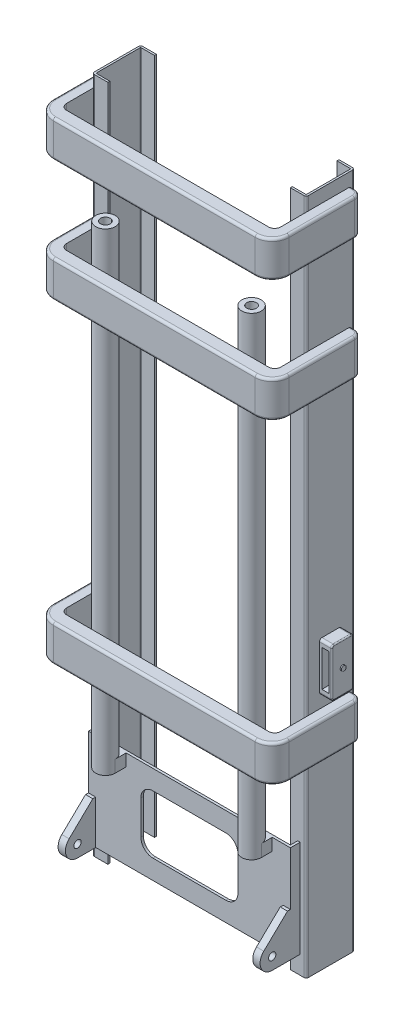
from build123d import *

# Parameters (mm, degrees)
BOSS_EXTRUDE1_DEPTH     = 2790
BOSS_EXTRUDE1_2_DEPTH   = 2790
BOSS_EXTRUDE2_START     = 75
BOSS_EXTRUDE2_DEPTH     = 400
BOSS_EXTRUDE3_START     = 25
SKETCH6_R               = 15
BOSS_EXTRUDE3_DEPTH     = 30
BOSS_EXTRUDE4_START     = 785
BOSS_EXTRUDE4_DEPTH     = 150
FILLET1_R               = 10
LPATTERN2_COUNT         = 2
LPATTERN2_PITCH         = 1800
FILLET1_OF_LPATTERN2_R  = 10
LPATTERN20_COUNT        = 2
LPATTERN20_PITCH        = 1300
FILLET1_OF_LPATTERN20_R = 10
CUT_EXTRUDE1_REACH      = 2951.751
BOSS_EXTRUDE5_DEPTH     = 50
BOSS_EXTRUDE6_START     = 1900
SKETCH10_R              = 40
SKETCH10_R_2            = 20
BOSS_EXTRUDE6_DEPTH     = 1900
BOSS_EXTRUDE7_DEPTH     = 50
SKETCH12_W              = 30
SKETCH12_H              = 150
CUT_EXTRUDE2_DEPTH      = 70
BOSS_EXTRUDE8_START     = -50
SKETCH13_R              = 10
BOSS_EXTRUDE8_DEPTH     = 55
FILLET2_R               = 5
FILLET2_OF_MIRROR2_R    = 5


with BuildPart() as part:
    # Sketch2 → Boss-Extrude1 (new body)
    with BuildSketch(Plane(origin=(0, 0, 0), x_dir=(1, 0, 0), z_dir=(0, 1, 0))):
        with BuildLine():
            Line((0, 10), (0, 190))
            ThreePointArc((0, 190), (2.928932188, 197.071067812), (10, 200))
            Line((10, 200), (65, 200))
            Line((65, 200), (65, 192))
            Line((65, 192), (10, 192))
            ThreePointArc((10, 192), (8.585786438, 191.414213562), (8, 190))
            Line((8, 190), (8, 10))
            ThreePointArc((8, 10), (8.585786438, 8.585786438), (10, 8))
            Line((10, 8), (65, 8))
            Line((65, 8), (65, 0))
            Line((65, 0), (10, 0))
            ThreePointArc((10, 0), (2.928932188, 2.928932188), (0, 10))
        make_face()
    extrude(amount=BOSS_EXTRUDE1_DEPTH)



with BuildPart() as body_2:
    # Sketch2 → Boss-Extrude1 2 (new body)
    with BuildSketch(Plane(origin=(0, 0, 0), x_dir=(1, 0, 0), z_dir=(0, 1, 0))):
        with BuildLine():
            Line((817, 8), (817, 0))
            Line((817, 0), (872, 0))
            ThreePointArc((872, 0), (879.071067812, 2.928932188), (882, 10))
            Line((882, 10), (882, 190))
            ThreePointArc((882, 190), (879.071067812, 197.071067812), (872, 200))
            Line((872, 200), (817, 200))
            Line((817, 200), (817, 192))
            Line((817, 192), (872, 192))
            ThreePointArc((872, 192), (873.414213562, 191.414213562), (874, 190))
            Line((874, 190), (874, 10))
            ThreePointArc((874, 10), (873.414213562, 8.585786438), (872, 8))
            Line((872, 8), (817, 8))
        make_face()
    extrude(amount=BOSS_EXTRUDE1_2_DEPTH)


with BuildPart() as part_1:
    add(part.part)

    add(body_2.part)  # Boss-Extrude2 merges body 2
    # Sketch4 → Boss-Extrude2 (add)
    with BuildSketch(Plane(origin=(0, 0, 0), x_dir=(1, 0, 0), z_dir=(0, 1, 0)).offset(BOSS_EXTRUDE2_START)):
        Polygon((25, 0), (25, -40), (857, -40), (857, 0), (847, 0), (847, -30), (35, -30), (35, 0), align=None)
    extrude(amount=BOSS_EXTRUDE2_DEPTH)

    # Sketch6 → Boss-Extrude3 (add)
    with BuildSketch(Plane(origin=(0, 0, 0), x_dir=(0, 0, -1), z_dir=(1, 0, 0)).offset(BOSS_EXTRUDE3_START)):
        with BuildLine():
            Line((-40, 75), (-115, 75))
            ThreePointArc((-115, 75), (-161.376393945, 106.312301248), (-149.666723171, 161.030796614))
            Line((-149.666723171, 161.030796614), (-52, 255))
            Line((-52, 255), (-40, 255))
            Line((-40, 255), (-40, 75))
        make_face()
        with Locations((-115, 125)):
            Circle(SKETCH6_R, mode=Mode.SUBTRACT)
    boss_extrude3 = extrude(amount=BOSS_EXTRUDE3_DEPTH)

    # Mirror1: Boss-Extrude3 across plane
    add(boss_extrude3.mirror(Plane.ZY.offset(-441)))

    # Sketch7 → Boss-Extrude4 (add)
    with BuildSketch(Plane(origin=(0, 0, 0), x_dir=(1, 0, 0), z_dir=(0, 1, 0)).offset(BOSS_EXTRUDE4_START)):
        with BuildLine():
            Line((0, 185), (-15, 185))
            ThreePointArc((-15, 185), (-36.213203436, 176.213203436), (-45, 155))
            Line((-45, 155), (-45, -115))
            ThreePointArc((-45, -115), (-24.497474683, -164.497474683), (25, -185))
            Line((25, -185), (857, -185))
            ThreePointArc((857, -185), (906.497474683, -164.497474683), (927, -115))
            Line((927, -115), (927, 155))
            ThreePointArc((927, 155), (918.213203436, 176.213203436), (897, 185))
            Line((897, 185), (882, 185))
            Line((882, 185), (882, -105))
            ThreePointArc((882, -105), (874.67766953, -122.67766953), (857, -130))
            Line((857, -130), (25, -130))
            ThreePointArc((25, -130), (7.32233047, -122.67766953), (0, -105))
            Line((0, -105), (0, 185))
        make_face()
    boss_extrude4 = extrude(amount=BOSS_EXTRUDE4_DEPTH)

    # Fillet1
    fillet1_edges = [part_1.edges().sort_by_distance(p)[0] for p in [
        (-7.5, 785, -185),
        (-36.213203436, 785, -176.213203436),
        (-45, 785, -20),
        (-24.497474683, 785, 164.497474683),
        (441, 785, 185),
        (906.497474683, 785, 164.497474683),
        (927, 785, -20),
        (918.213203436, 785, -176.213203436),
        (889.5, 785, -185),
        (-7.5, 935, -185),
        (-36.213203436, 935, -176.213203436),
        (-45, 935, -20),
        (-24.497474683, 935, 164.497474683),
        (441, 935, 185),
        (906.497474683, 935, 164.497474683),
        (927, 935, -20),
        (918.213203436, 935, -176.213203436),
        (889.5, 935, -185),
    ]]
    fillet(fillet1_edges, radius=FILLET1_R)

    # LPattern2: Boss-Extrude4 ×2
    with Locations(*[(0, i * LPATTERN2_PITCH, 0) for i in range(1, LPATTERN2_COUNT)]):
        add(boss_extrude4)

    # Fillet1 of LPattern2
    fillet1_of_lpattern2_edges = [part_1.edges().sort_by_distance(p)[0] for p in [
        (-7.5, 2585, -185),
        (-36.213203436, 2585, -176.213203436),
        (-45, 2585, -20),
        (-24.497474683, 2585, 164.497474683),
        (441, 2585, 185),
        (906.497474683, 2585, 164.497474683),
        (927, 2585, -20),
        (918.213203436, 2585, -176.213203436),
        (889.5, 2585, -185),
        (-7.5, 2735, -185),
        (-36.213203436, 2735, -176.213203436),
        (-45, 2735, -20),
        (-24.497474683, 2735, 164.497474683),
        (441, 2735, 185),
        (906.497474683, 2735, 164.497474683),
        (927, 2735, -20),
        (918.213203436, 2735, -176.213203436),
        (889.5, 2735, -185),
    ]]
    fillet(fillet1_of_lpattern2_edges, radius=FILLET1_OF_LPATTERN2_R)

    # LPattern20: Boss-Extrude4 ×2
    with Locations(*[(0, i * LPATTERN20_PITCH, 0) for i in range(1, LPATTERN20_COUNT)]):
        add(boss_extrude4)

    # Fillet1 of LPattern20
    fillet1_of_lpattern20_edges = [part_1.edges().sort_by_distance(p)[0] for p in [
        (-7.5, 2085, -185),
        (-36.213203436, 2085, -176.213203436),
        (-45, 2085, -20),
        (-24.497474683, 2085, 164.497474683),
        (441, 2085, 185),
        (906.497474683, 2085, 164.497474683),
        (927, 2085, -20),
        (918.213203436, 2085, -176.213203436),
        (889.5, 2085, -185),
        (-7.5, 2235, -185),
        (-36.213203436, 2235, -176.213203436),
        (-45, 2235, -20),
        (-24.497474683, 2235, 164.497474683),
        (441, 2235, 185),
        (906.497474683, 2235, 164.497474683),
        (927, 2235, -20),
        (918.213203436, 2235, -176.213203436),
        (889.5, 2235, -185),
    ]]
    fillet(fillet1_of_lpattern20_edges, radius=FILLET1_OF_LPATTERN20_R)

    # Sketch8 → Cut-Extrude1 (cut, up to next)
    with BuildSketch(Plane.XY.offset(40), mode=Mode.PRIVATE) as cut_extrude1_sk1:
        with BuildLine():
            Line((291, 395), (591, 395))
            ThreePointArc((591, 395), (626.355339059, 380.355339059), (641, 345))
            Line((641, 345), (641, 205))
            ThreePointArc((641, 205), (626.355339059, 169.644660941), (591, 155))
            Line((591, 155), (291, 155))
            ThreePointArc((291, 155), (255.644660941, 169.644660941), (241, 205))
            Line((241, 205), (241, 345))
            ThreePointArc((241, 345), (255.644660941, 380.355339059), (291, 395))
        make_face()
    cut_extrude1_tool1 = extrude(cut_extrude1_sk1.sketch, amount=-CUT_EXTRUDE1_REACH, mode=Mode.PRIVATE) & part_1.part
    add(cut_extrude1_tool1.solids().sort_by_distance((441, 275, 40))[0], mode=Mode.SUBTRACT)

    # Sketch9 → Boss-Extrude5 (add)
    with BuildSketch(Plane(origin=(0, 475, 0), x_dir=(1, 0, 0), z_dir=(0, 1, 0))):
        with BuildLine():
            Line((782, -85), (782, -40))
            Line((782, -40), (702, -40))
            Line((702, -40), (702, -85))
            ThreePointArc((702, -85), (742, -125), (782, -85))
        make_face()
        with BuildLine():
            Line((100, -40), (180, -40))
            Line((180, -40), (180, -85))
            ThreePointArc((180, -85), (140, -125), (100, -85))
            Line((100, -85), (100, -40))
        make_face()
    extrude(amount=-BOSS_EXTRUDE5_DEPTH)

    # Sketch10 → Boss-Extrude6 (add)
    # profile 1 of 2: a face of its own
    with BuildSketch(Plane(origin=(0, 475, 0), x_dir=(1, 0, 0), z_dir=(0, 1, 0)).offset(BOSS_EXTRUDE6_START)):
        with Locations(Location((140, -85, 0), (0, 0, 270))):
            Circle(SKETCH10_R)
        with Locations(Location((140, -85, 0), (0, 0, 90))):
            Circle(SKETCH10_R_2, mode=Mode.SUBTRACT)
    # profile 2 of 2: a face of its own
    with BuildSketch(Plane(origin=(0, 475, 0), x_dir=(1, 0, 0), z_dir=(0, 1, 0)).offset(BOSS_EXTRUDE6_START)):
        with Locations(Location((742, -85, 0), (0, 0, 270))):
            Circle(SKETCH10_R)
        with Locations(Location((742, -85, 0), (0, 0, 90))):
            Circle(SKETCH10_R_2, mode=Mode.SUBTRACT)
    extrude(amount=-BOSS_EXTRUDE6_DEPTH)

    # Sketch11 → Boss-Extrude7 (add)
    with BuildSketch(Plane.ZY):
        with BuildLine():
            Line((-135, 1185), (-65, 1185))
            ThreePointArc((-65, 1185), (-57.928932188, 1182.071067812), (-55, 1175))
            Line((-55, 1175), (-55, 995))
            ThreePointArc((-55, 995), (-57.928932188, 987.928932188), (-65, 985))
            Line((-65, 985), (-135, 985))
            ThreePointArc((-135, 985), (-142.071067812, 987.928932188), (-145, 995))
            Line((-145, 995), (-145, 1175))
            ThreePointArc((-145, 1175), (-142.071067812, 1182.071067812), (-135, 1185))
        make_face()
    boss_extrude7 = extrude(amount=BOSS_EXTRUDE7_DEPTH)

    # Sketch12 → Cut-Extrude2 (cut)
    with BuildSketch(Plane.XY.offset(-55)):
        with Locations((-24.5, 1085)):
            Rectangle(SKETCH12_W, SKETCH12_H)
    cut_extrude2 = extrude(amount=-CUT_EXTRUDE2_DEPTH, mode=Mode.SUBTRACT)

    # Sketch13 → Boss-Extrude8 (add)
    with BuildSketch(Plane.ZY.offset(50).offset(BOSS_EXTRUDE8_START)):
        with Locations(Location((-100, 1085, 0), (0, 0, 90))):
            Circle(SKETCH13_R)
    boss_extrude8 = extrude(amount=BOSS_EXTRUDE8_DEPTH)

    # Fillet2
    fillet2_edges = [part_1.edges().sort_by_distance(p)[0] for p in [
        (-50, 987.928932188, -57.928932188),
        (-50, 1085, -55),
        (-50, 1182.071067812, -57.928932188),
        (-50, 1185, -100),
        (-50, 1182.071067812, -142.071067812),
        (-50, 1085, -145),
        (-50, 987.928932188, -142.071067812),
        (-50, 985, -100),
    ]]
    fillet(fillet2_edges, radius=FILLET2_R)

    # Mirror2: Boss-Extrude7, Cut-Extrude2, Boss-Extrude8 across plane
    add(boss_extrude7.mirror(Plane.ZY.offset(-441)))
    add(cut_extrude2.mirror(Plane.ZY.offset(-441)), mode=Mode.SUBTRACT)
    add(boss_extrude8.mirror(Plane.ZY.offset(-441)))

    # Fillet2 of Mirror2
    fillet2_of_mirror2_edges = [part_1.edges().sort_by_distance(p)[0] for p in [
        (932, 987.928932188, -57.928932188),
        (932, 1085, -55),
        (932, 1182.071067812, -57.928932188),
        (932, 1185, -100),
        (932, 1182.071067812, -142.071067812),
        (932, 1085, -145),
        (932, 987.928932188, -142.071067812),
        (932, 985, -100),
    ]]
    fillet(fillet2_of_mirror2_edges, radius=FILLET2_OF_MIRROR2_R)


solid = part_1.part
